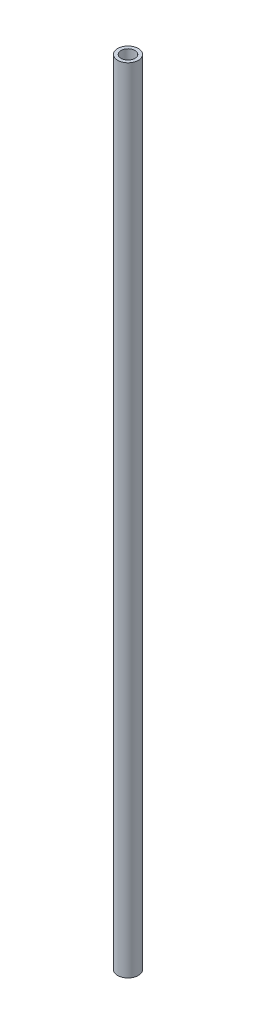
from build123d import *

# Parameters (mm, degrees)
SKETCH1_R           = 3.9624
SKETCH1_R_2         = 2.667
BOSS_EXTRUDE1_DEPTH = 304.8


with BuildPart() as part:
    # Sketch1 → Boss-Extrude1 (new body)
    with BuildSketch(Plane(origin=(0, 0, 0), x_dir=(1, 0, 0), z_dir=(0, 1, 0))):
        with Locations(Location((0, 0, 0), (0, 0, 90))):
            Circle(SKETCH1_R)
        with Locations(Location((0, 0, 0), (0, 0, 90))):
            Circle(SKETCH1_R_2, mode=Mode.SUBTRACT)
    extrude(amount=BOSS_EXTRUDE1_DEPTH)


solid = part.part
